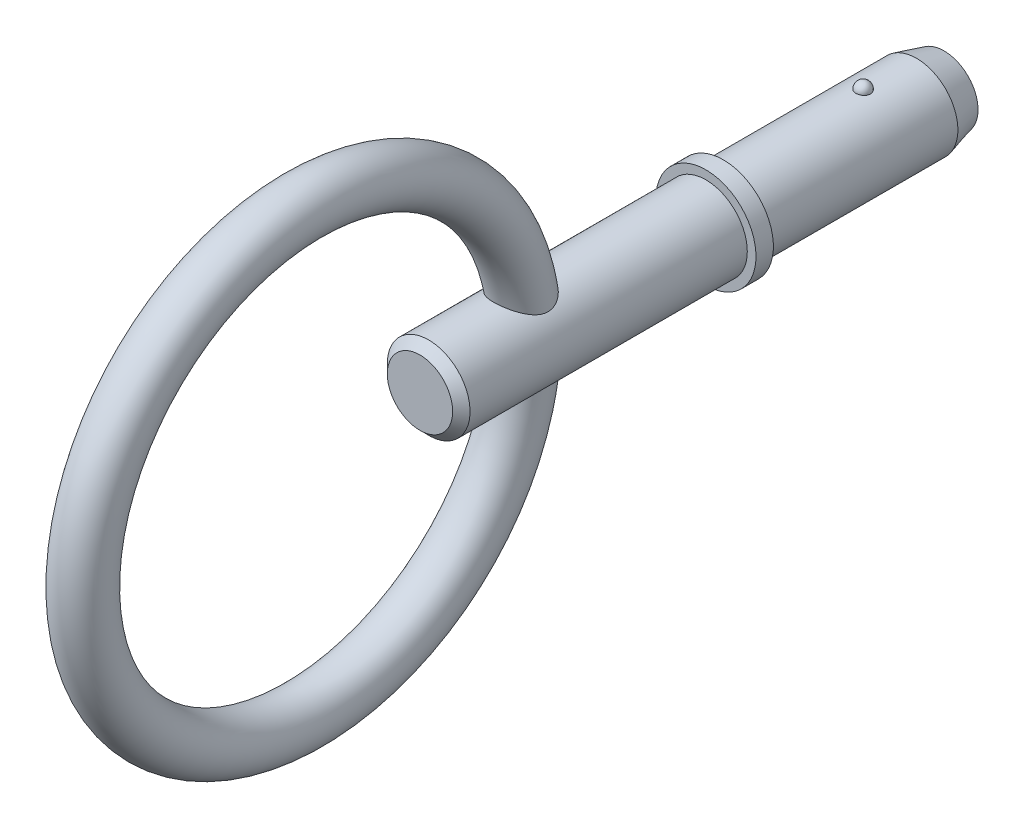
from build123d import *

# Parameters (mm, degrees)
SKETCH2_R           = 2.38
BOSS_EXTRUDE1_DEPTH = 7.62
BOSS_EXTRUDE2_START = 5.08
SKETCH3_R           = 2.38
BOSS_EXTRUDE2_DEPTH = 5.08
CHAMFER1_SIZE       = 1.586
CHAMFER1_SIZE2      = 0.424967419
SKETCH20_W          = 1
SKETCH20_H          = 2.88
SKETCH21_R          = 2.38
BOSS_EXTRUDE3_DEPTH = 17.45
CHAMFER2_SIZE       = 0.5
SKETCH24_R          = 1.5


with BuildPart() as part:
    # Sketch2 → Boss-Extrude1 (new body)
    with BuildSketch(Plane.XY):
        Circle(SKETCH2_R)
    extrude(amount=BOSS_EXTRUDE1_DEPTH)

    # Sketch3 → Boss-Extrude2 (add)
    with BuildSketch(Plane(origin=(0, 0, 0), x_dir=(-1, 0, 0), z_dir=(0, 0, -1)).offset(BOSS_EXTRUDE2_START)):
        Circle(SKETCH3_R)
    extrude(amount=-BOSS_EXTRUDE2_DEPTH)

    # Chamfer1
    chamfer1_edges = [part.edges().sort_by_distance(p)[0] for p in [
        (2.38, 0, -5.08),
    ]]
    chamfer1_side = [part.faces().sort_by_distance(p)[0] for p in [
        (2.38, 0, -2.54),
    ]]
    chamfer(chamfer1_edges, length=CHAMFER1_SIZE, length2=CHAMFER1_SIZE2, reference=chamfer1_side[0])

    # Sketch18 → Revolve1 (revolve)
    with BuildSketch(Plane(origin=(0, 0, 0), x_dir=(0, 0, -1), z_dir=(1, 0, 0))):
        with BuildLine():
            Line((0.42, 2.8), (0.42, 1.96))
            ThreePointArc((0.42, 1.96), (0, 2.38), (0.42, 2.8))
        make_face()
    revolve(axis=Axis((0, 2.8, -0.42), (0, -1, 0)))

    # Sketch20 → Revolve2 (revolve)
    with BuildSketch(Plane(origin=(0, 0, 0), x_dir=(0, 0, -1), z_dir=(1, 0, 0)), mode=Mode.PRIVATE) as revolve2_sk:
        with Locations((-8.12, 1.44)):
            Rectangle(SKETCH20_W, SKETCH20_H)
    revolve(revolve2_sk.sketch.rotate(Axis((0, 0, 33.728787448), (0, 0, 1)), 90), axis=Axis((0, 0, 33.728787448), (0, 0, 1)))

    # Sketch21 → Boss-Extrude3 (add)
    with BuildSketch(Plane(origin=(0, 0, 7.62), x_dir=(-1, 0, 0), z_dir=(0, 0, -1))):
        Circle(SKETCH21_R)
    extrude(amount=-BOSS_EXTRUDE3_DEPTH)

    # Chamfer2
    chamfer2_edges = [part.edges().sort_by_distance(p)[0] for p in [
        (2.38, 0, 25.07),
    ]]
    chamfer(chamfer2_edges, length=CHAMFER2_SIZE)

    # Sweep1: sweep along a path in Sketch23
    with BuildLine(Plane(origin=(0, 0, 0), x_dir=(0, 0, -1), z_dir=(1, 0, 0))) as sweep1_path:
        CenterArc((-31.77, 0), 12.7, 0, 360)
    # Sketch24 → Sweep1 (sweep)
    with BuildSketch(Plane(origin=(0, 0, 0), x_dir=(1, 0, 0), z_dir=(0, 1, 0))):
        with Locations((0, -19.07)):
            Circle(SKETCH24_R)
    sweep(path=sweep1_path.line)


solid = part.part
